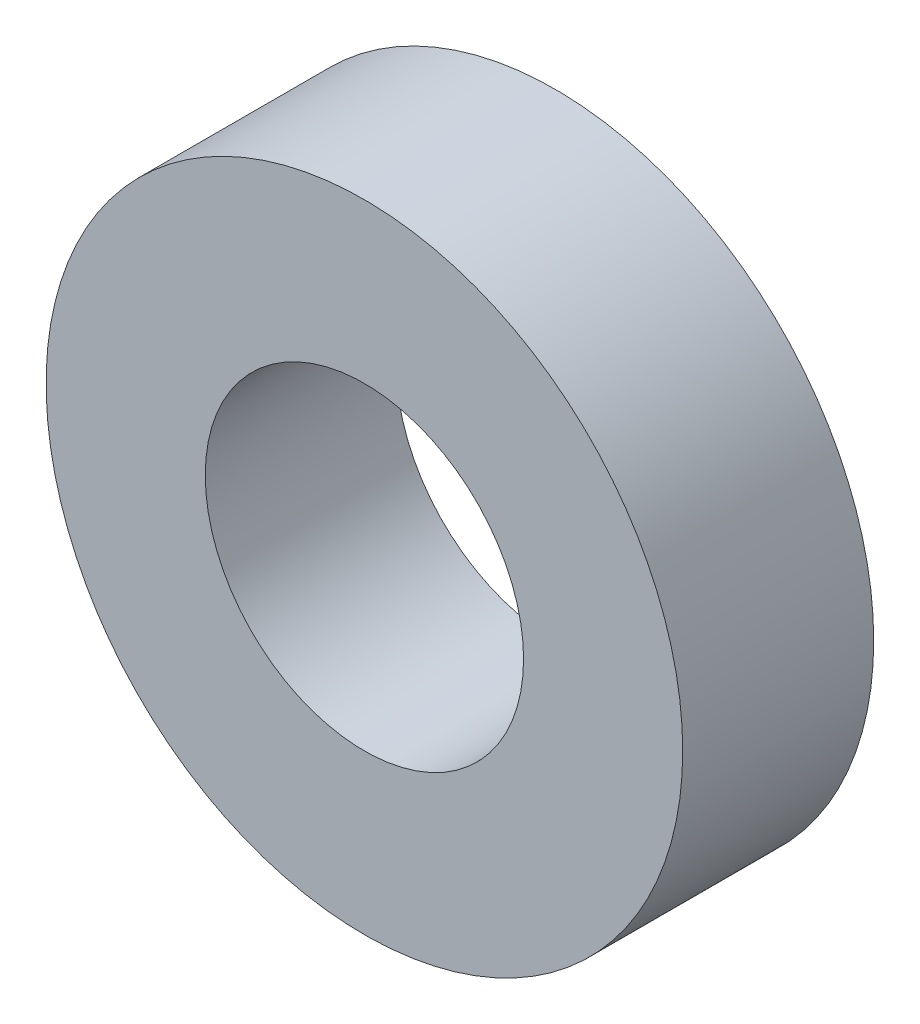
ISO-10303-21;
HEADER;
FILE_DESCRIPTION(('STEP AP214'),'2;1');
FILE_NAME('part.step','',(''),(''),'','','');
FILE_SCHEMA(('AUTOMOTIVE_DESIGN { 1 0 10303 214 1 1 1 1 }'));
ENDSEC;
DATA;
#1=APPLICATION_CONTEXT('core data for automotive mechanical design processes');
#2=APPLICATION_PROTOCOL_DEFINITION('international standard','automotive_design',2000,#1);
#3=PRODUCT_CONTEXT('',#1,'mechanical');
#4=PRODUCT('Part','Part','',(#3));
#5=PRODUCT_RELATED_PRODUCT_CATEGORY('part','',(#4));
#6=PRODUCT_DEFINITION_FORMATION('','',#4);
#7=PRODUCT_DEFINITION_CONTEXT('part definition',#1,'design');
#8=PRODUCT_DEFINITION('design','',#6,#7);
#9=PRODUCT_DEFINITION_SHAPE('','',#8);
#10=(LENGTH_UNIT() NAMED_UNIT(*) SI_UNIT(.MILLI.,.METRE.));
#11=(NAMED_UNIT(*) PLANE_ANGLE_UNIT() SI_UNIT($,.RADIAN.));
#12=(NAMED_UNIT(*) SI_UNIT($,.STERADIAN.) SOLID_ANGLE_UNIT());
#13=UNCERTAINTY_MEASURE_WITH_UNIT(LENGTH_MEASURE(1.E-05),#10,'distance_accuracy_value','');
#14=(GEOMETRIC_REPRESENTATION_CONTEXT(3) GLOBAL_UNCERTAINTY_ASSIGNED_CONTEXT((#13)) GLOBAL_UNIT_ASSIGNED_CONTEXT((#10,
#11,#12)) REPRESENTATION_CONTEXT('',''));
#15=CARTESIAN_POINT('',(0.,0.,0.));
#16=DIRECTION('',(0.,0.,1.));
#17=DIRECTION('',(1.,0.,0.));
#18=AXIS2_PLACEMENT_3D('',#15,#16,#17);
#19=CARTESIAN_POINT('',(0.,0.,6.));
#20=DIRECTION('',(0.,0.,1.));
#21=DIRECTION('',(1.,0.,0.));
#22=AXIS2_PLACEMENT_3D('',#19,#20,#21);
#23=PLANE('',#22);
#24=CARTESIAN_POINT('',(0.,0.,6.));
#25=DIRECTION('',(0.,0.,1.));
#26=DIRECTION('',(1.,0.,0.));
#27=AXIS2_PLACEMENT_3D('',#24,#25,#26);
#28=CIRCLE('',#27,10.);
#29=CARTESIAN_POINT('',(10.,0.,6.));
#30=VERTEX_POINT('',#29);
#31=EDGE_CURVE('E10',#30,#30,#28,.T.);
#32=ORIENTED_EDGE('',*,*,#31,.T.);
#33=EDGE_LOOP('',(#32));
#34=FACE_BOUND('',#33,.T.);
#35=CARTESIAN_POINT('',(0.,0.,6.));
#36=DIRECTION('',(0.,0.,1.));
#37=DIRECTION('',(1.,0.,0.));
#38=AXIS2_PLACEMENT_3D('',#35,#36,#37);
#39=CIRCLE('',#38,5.);
#40=CARTESIAN_POINT('',(5.,0.,6.));
#41=VERTEX_POINT('',#40);
#42=EDGE_CURVE('E39',#41,#41,#39,.T.);
#43=ORIENTED_EDGE('',*,*,#42,.F.);
#44=EDGE_LOOP('',(#43));
#45=FACE_BOUND('',#44,.T.);
#46=ADVANCED_FACE('F28',(#34,#45),#23,.T.);
#47=CARTESIAN_POINT('',(0.,0.,0.));
#48=DIRECTION('',(0.,0.,1.));
#49=DIRECTION('',(1.,0.,0.));
#50=AXIS2_PLACEMENT_3D('',#47,#48,#49);
#51=PLANE('',#50);
#52=CARTESIAN_POINT('',(0.,0.,0.));
#53=DIRECTION('',(0.,0.,1.));
#54=DIRECTION('',(1.,0.,0.));
#55=AXIS2_PLACEMENT_3D('',#52,#53,#54);
#56=CIRCLE('',#55,10.);
#57=CARTESIAN_POINT('',(10.,0.,0.));
#58=VERTEX_POINT('',#57);
#59=EDGE_CURVE('E32',#58,#58,#56,.T.);
#60=ORIENTED_EDGE('',*,*,#59,.F.);
#61=EDGE_LOOP('',(#60));
#62=FACE_BOUND('',#61,.T.);
#63=CARTESIAN_POINT('',(0.,0.,0.));
#64=DIRECTION('',(0.,0.,1.));
#65=DIRECTION('',(1.,0.,0.));
#66=AXIS2_PLACEMENT_3D('',#63,#64,#65);
#67=CIRCLE('',#66,5.);
#68=CARTESIAN_POINT('',(5.,0.,0.));
#69=VERTEX_POINT('',#68);
#70=EDGE_CURVE('E41',#69,#69,#67,.T.);
#71=ORIENTED_EDGE('',*,*,#70,.T.);
#72=EDGE_LOOP('',(#71));
#73=FACE_BOUND('',#72,.T.);
#74=ADVANCED_FACE('F51',(#62,#73),#51,.F.);
#75=CARTESIAN_POINT('',(0.,0.,6.));
#76=DIRECTION('',(0.,0.,-1.));
#77=DIRECTION('',(-1.,0.,0.));
#78=AXIS2_PLACEMENT_3D('',#75,#76,#77);
#79=CYLINDRICAL_SURFACE('',#78,10.);
#80=ORIENTED_EDGE('',*,*,#31,.F.);
#81=EDGE_LOOP('',(#80));
#82=FACE_BOUND('',#81,.T.);
#83=ORIENTED_EDGE('',*,*,#59,.T.);
#84=EDGE_LOOP('',(#83));
#85=FACE_BOUND('',#84,.T.);
#86=ADVANCED_FACE('F30',(#82,#85),#79,.T.);
#87=CARTESIAN_POINT('',(0.,0.,6.));
#88=DIRECTION('',(0.,0.,-1.));
#89=DIRECTION('',(-1.,0.,0.));
#90=AXIS2_PLACEMENT_3D('',#87,#88,#89);
#91=CYLINDRICAL_SURFACE('',#90,5.);
#92=ORIENTED_EDGE('',*,*,#42,.T.);
#93=EDGE_LOOP('',(#92));
#94=FACE_BOUND('',#93,.T.);
#95=ORIENTED_EDGE('',*,*,#70,.F.);
#96=EDGE_LOOP('',(#95));
#97=FACE_BOUND('',#96,.T.);
#98=ADVANCED_FACE('F47',(#94,#97),#91,.F.);
#99=CLOSED_SHELL('',(#46,#74,#86,#98));
#100=MANIFOLD_SOLID_BREP('B2',#99);
#101=ADVANCED_BREP_SHAPE_REPRESENTATION('',(#18,#100),#14);
#102=SHAPE_DEFINITION_REPRESENTATION(#9,#101);
ENDSEC;
END-ISO-10303-21;
